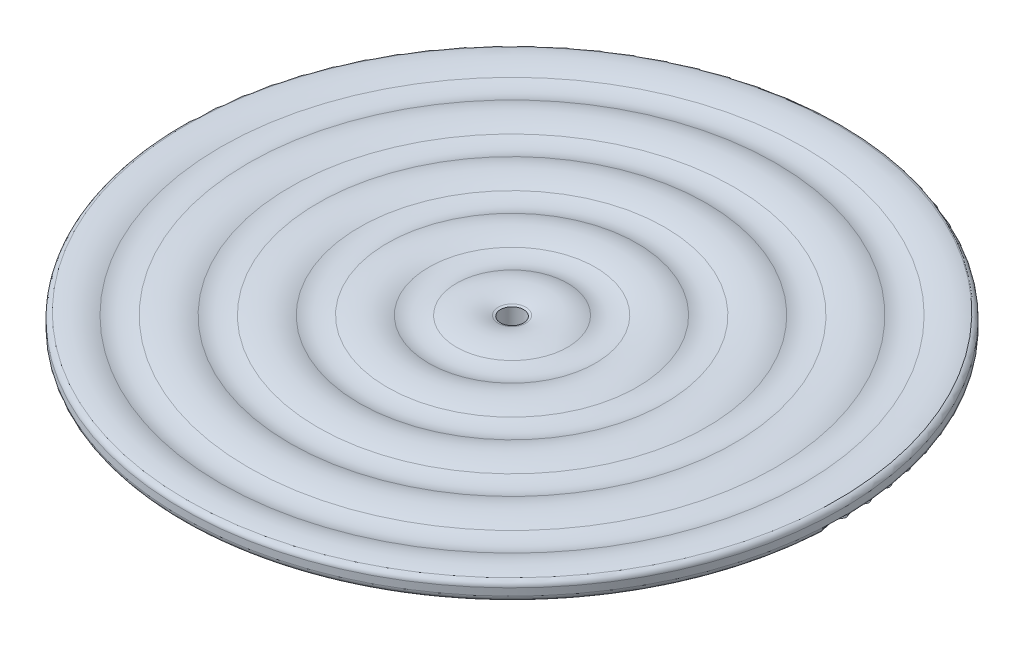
ISO-10303-21;
HEADER;
FILE_DESCRIPTION(('STEP AP214'),'2;1');
FILE_NAME('part.step','',(''),(''),'','','');
FILE_SCHEMA(('AUTOMOTIVE_DESIGN { 1 0 10303 214 1 1 1 1 }'));
ENDSEC;
DATA;
#1=APPLICATION_CONTEXT('core data for automotive mechanical design processes');
#2=APPLICATION_PROTOCOL_DEFINITION('international standard','automotive_design',2000,#1);
#3=PRODUCT_CONTEXT('',#1,'mechanical');
#4=PRODUCT('Part','Part','',(#3));
#5=PRODUCT_RELATED_PRODUCT_CATEGORY('part','',(#4));
#6=PRODUCT_DEFINITION_FORMATION('','',#4);
#7=PRODUCT_DEFINITION_CONTEXT('part definition',#1,'design');
#8=PRODUCT_DEFINITION('design','',#6,#7);
#9=PRODUCT_DEFINITION_SHAPE('','',#8);
#10=(LENGTH_UNIT() NAMED_UNIT(*) SI_UNIT(.MILLI.,.METRE.));
#11=(NAMED_UNIT(*) PLANE_ANGLE_UNIT() SI_UNIT($,.RADIAN.));
#12=(NAMED_UNIT(*) SI_UNIT($,.STERADIAN.) SOLID_ANGLE_UNIT());
#13=UNCERTAINTY_MEASURE_WITH_UNIT(LENGTH_MEASURE(1.E-05),#10,'distance_accuracy_value','');
#14=(GEOMETRIC_REPRESENTATION_CONTEXT(3) GLOBAL_UNCERTAINTY_ASSIGNED_CONTEXT((#13)) GLOBAL_UNIT_ASSIGNED_CONTEXT((#10,
#11,#12)) REPRESENTATION_CONTEXT('',''));
#15=CARTESIAN_POINT('',(0.,0.,0.));
#16=DIRECTION('',(0.,0.,1.));
#17=DIRECTION('',(1.,0.,0.));
#18=AXIS2_PLACEMENT_3D('',#15,#16,#17);
#19=CARTESIAN_POINT('',(0.,18.5404962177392,0.));
#20=DIRECTION('',(0.,1.,0.));
#21=DIRECTION('',(1.,0.,0.));
#22=AXIS2_PLACEMENT_3D('',#19,#20,#21);
#23=SPHERICAL_SURFACE('',#22,24.);
#24=CARTESIAN_POINT('',(0.,-3.70809924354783,0.));
#25=DIRECTION('',(0.,1.,0.));
#26=DIRECTION('',(0.,0.,1.));
#27=AXIS2_PLACEMENT_3D('',#24,#25,#26);
#28=CIRCLE('',#27,8.99999999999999);
#29=CARTESIAN_POINT('',(8.99999999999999,-3.70809924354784,0.));
#30=VERTEX_POINT('',#29);
#31=EDGE_CURVE('E75',#30,#30,#28,.T.);
#32=CARTESIAN_POINT('',(0.,-4.93289297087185,0.));
#33=DIRECTION('',(0.,1.,0.));
#34=DIRECTION('',(0.,0.,1.));
#35=AXIS2_PLACEMENT_3D('',#32,#33,#34);
#36=CIRCLE('',#35,5.);
#37=CARTESIAN_POINT('',(4.99999999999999,-4.93289297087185,0.));
#38=VERTEX_POINT('',#37);
#39=EDGE_CURVE('E105',#38,#38,#36,.F.);
#40=CARTESIAN_POINT('',(8.99999999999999,-3.70809924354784,0.));
#41=CARTESIAN_POINT('',(8.95955247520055,-3.7244610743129,0.));
#42=CARTESIAN_POINT('',(8.91906033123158,-3.74071260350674,0.));
#43=CARTESIAN_POINT('',(8.83798801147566,-3.7729945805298,0.));
#44=CARTESIAN_POINT('',(8.79740783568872,-3.78902502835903,0.));
#45=CARTESIAN_POINT('',(8.71616065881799,-3.82086436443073,0.));
#46=CARTESIAN_POINT('',(8.67549365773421,-3.8366732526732,0.));
#47=CARTESIAN_POINT('',(8.5940740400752,-3.86806899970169,0.));
#48=CARTESIAN_POINT('',(8.55332142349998,-3.88365585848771,0.));
#49=CARTESIAN_POINT('',(8.47173178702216,-3.91460708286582,0.));
#50=CARTESIAN_POINT('',(8.43089476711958,-3.92997144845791,0.));
#51=CARTESIAN_POINT('',(8.34913753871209,-3.96047722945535,0.));
#52=CARTESIAN_POINT('',(8.3082173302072,-3.97561864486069,0.));
#53=CARTESIAN_POINT('',(8.22629494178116,-4.00567807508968,0.));
#54=CARTESIAN_POINT('',(8.18529276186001,-4.02059608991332,0.));
#55=CARTESIAN_POINT('',(8.10320765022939,-4.05020827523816,0.));
#56=CARTESIAN_POINT('',(8.06212471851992,-4.06490244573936,0.));
#57=CARTESIAN_POINT('',(7.97987932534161,-4.09406650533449,0.));
#58=CARTESIAN_POINT('',(7.93871686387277,-4.10853639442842,0.));
#59=CARTESIAN_POINT('',(7.85631363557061,-4.13725146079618,0.));
#60=CARTESIAN_POINT('',(7.81507286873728,-4.15149663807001,0.));
#61=CARTESIAN_POINT('',(7.73251425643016,-4.17976185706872,0.));
#62=CARTESIAN_POINT('',(7.69119641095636,-4.19378189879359,0.));
#63=CARTESIAN_POINT('',(7.60848487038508,-4.22159642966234,0.));
#64=CARTESIAN_POINT('',(7.56709117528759,-4.23539091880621,0.));
#65=CARTESIAN_POINT('',(7.48422916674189,-4.26275393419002,0.));
#66=CARTESIAN_POINT('',(7.44276085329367,-4.27632246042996,0.));
#67=CARTESIAN_POINT('',(7.359750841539,-4.30323314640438,0.));
#68=CARTESIAN_POINT('',(7.31820914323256,-4.31657530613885,0.));
#69=CARTESIAN_POINT('',(7.23505359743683,-4.34303286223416,0.));
#70=CARTESIAN_POINT('',(7.19343974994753,-4.35614825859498,0.));
#71=CARTESIAN_POINT('',(7.11014114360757,-4.38215189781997,0.));
#72=CARTESIAN_POINT('',(7.0684563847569,-4.39504014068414,0.));
#73=CARTESIAN_POINT('',(6.98501719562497,-4.42058908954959,0.));
#74=CARTESIAN_POINT('',(6.94326276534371,-4.43324979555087,0.));
#75=CARTESIAN_POINT('',(6.85968547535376,-4.45834329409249,0.));
#76=CARTESIAN_POINT('',(6.81786261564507,-4.47077608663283,0.));
#77=CARTESIAN_POINT('',(6.7341497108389,-4.4954133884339,0.));
#78=CARTESIAN_POINT('',(6.69225966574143,-4.50761789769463,0.));
#79=CARTESIAN_POINT('',(6.60841363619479,-4.5317982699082,0.));
#80=CARTESIAN_POINT('',(6.56645765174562,-4.54377413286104,0.));
#81=CARTESIAN_POINT('',(6.48248099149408,-4.56749685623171,0.));
#82=CARTESIAN_POINT('',(6.44046031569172,-4.57924371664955,0.));
#83=CARTESIAN_POINT('',(6.35635552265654,-4.6025080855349,0.));
#84=CARTESIAN_POINT('',(6.31427140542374,-4.61402559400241,0.));
#85=CARTESIAN_POINT('',(6.23004098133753,-4.63683091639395,0.));
#86=CARTESIAN_POINT('',(6.18789467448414,-4.64811873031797,0.));
#87=CARTESIAN_POINT('',(6.10354112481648,-4.67046432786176,0.));
#88=CARTESIAN_POINT('',(6.06133388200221,-4.68152211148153,0.));
#89=CARTESIAN_POINT('',(5.97685971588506,-4.70340731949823,0.));
#90=CARTESIAN_POINT('',(5.93459279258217,-4.71423474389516,0.));
#91=CARTESIAN_POINT('',(5.85000052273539,-4.7356589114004,0.));
#92=CARTESIAN_POINT('',(5.80767517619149,-4.74625565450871,0.));
#93=CARTESIAN_POINT('',(5.72296731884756,-4.7672181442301,0.));
#94=CARTESIAN_POINT('',(5.68058480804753,-4.77758389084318,0.));
#95=CARTESIAN_POINT('',(5.59576388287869,-4.79808407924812,0.));
#96=CARTESIAN_POINT('',(5.55332546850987,-4.80821852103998,0.));
#97=CARTESIAN_POINT('',(5.46839399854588,-4.82825579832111,0.));
#98=CARTESIAN_POINT('',(5.4259009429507,-4.83815863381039,0.));
#99=CARTESIAN_POINT('',(5.34086145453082,-4.85773240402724,0.));
#100=CARTESIAN_POINT('',(5.29831502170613,-4.86740333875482,0.));
#101=CARTESIAN_POINT('',(5.21317004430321,-4.88651301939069,0.));
#102=CARTESIAN_POINT('',(5.17057149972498,-4.89595176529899,0.));
#103=CARTESIAN_POINT('',(5.08532356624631,-4.91459678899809,0.));
#104=CARTESIAN_POINT('',(5.04267417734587,-4.92380306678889,0.));
#105=CARTESIAN_POINT('',(4.99999999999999,-4.93289297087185,0.));
#106=B_SPLINE_CURVE_WITH_KNOTS('',3,(#40,#41,#42,#43,#44,#45,#46,#47,#48,#49,#50,#51,#52,#53,
#54,#55,#56,#57,#58,#59,#60,#61,#62,#63,#64,#65,#66,#67,#68,#69,#70,#71,#72,#73,#74,#75,#76,#77,
#78,#79,#80,#81,#82,#83,#84,#85,#86,#87,#88,#89,#90,#91,#92,#93,#94,#95,#96,#97,#98,#99,#100,
#101,#102,#103,#104,#105),.UNSPECIFIED.,.F.,.F.,(4,2,2,2,2,2,2,2,2,2,2,2,2,2,2,2,2,2,2,2,2,2,2,
2,2,2,2,2,2,2,2,2,4),(0.,0.130894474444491,0.261788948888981,0.392683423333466,
0.523577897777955,0.654472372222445,0.785366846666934,0.916261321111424,1.04715579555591,
1.1780502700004,1.30894474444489,1.43983921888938,1.57073369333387,1.70162816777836,
1.83252264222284,1.96341711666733,2.09431159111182,2.22520606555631,2.3561005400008,
2.48699501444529,2.61788948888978,2.74878396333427,2.87967843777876,3.01057291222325,
3.14146738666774,3.27236186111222,3.40325633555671,3.5341508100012,3.66504528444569,
3.79593975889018,3.92683423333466,4.05772870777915,4.18862318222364),.UNSPECIFIED.);
#107=EDGE_CURVE('BSEAM31',#30,#38,#106,.T.);
#108=ORIENTED_EDGE('',*,*,#31,.F.);
#109=ORIENTED_EDGE('',*,*,#39,.F.);
#110=ORIENTED_EDGE('',*,*,#107,.T.);
#111=ORIENTED_EDGE('',*,*,#107,.F.);
#112=EDGE_LOOP('',(#108,#110,#109,#111));
#113=FACE_BOUND('',#112,.T.);
#114=ADVANCED_FACE('F31',(#113),#23,.T.);
#115=CARTESIAN_POINT('',(0.,18.5404962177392,0.));
#116=DIRECTION('',(0.,1.,0.));
#117=DIRECTION('',(1.,0.,0.));
#118=AXIS2_PLACEMENT_3D('',#115,#116,#117);
#119=SPHERICAL_SURFACE('',#118,16.);
#120=CARTESIAN_POINT('',(0.,3.70809924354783,0.));
#121=DIRECTION('',(0.,1.,0.));
#122=DIRECTION('',(0.,0.,1.));
#123=AXIS2_PLACEMENT_3D('',#120,#121,#122);
#124=CIRCLE('',#123,6.);
#125=CARTESIAN_POINT('',(6.,3.70809924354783,0.));
#126=VERTEX_POINT('',#125);
#127=EDGE_CURVE('E78',#126,#126,#124,.T.);
#128=CARTESIAN_POINT('',(0.,3.34181206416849,0.));
#129=DIRECTION('',(0.,1.,0.));
#130=DIRECTION('',(0.,0.,1.));
#131=AXIS2_PLACEMENT_3D('',#128,#129,#130);
#132=CIRCLE('',#131,5.);
#133=CARTESIAN_POINT('',(5.,3.34181206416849,0.));
#134=VERTEX_POINT('',#133);
#135=EDGE_CURVE('E35',#134,#134,#132,.T.);
#136=CARTESIAN_POINT('',(6.,3.70809924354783,0.));
#137=CARTESIAN_POINT('',(5.98971418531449,3.7039384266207,0.));
#138=CARTESIAN_POINT('',(5.97942404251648,3.69978830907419,0.));
#139=CARTESIAN_POINT('',(5.95883514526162,3.6915094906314,0.));
#140=CARTESIAN_POINT('',(5.94853639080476,3.68738078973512,0.));
#141=CARTESIAN_POINT('',(5.92793031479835,3.67914482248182,0.));
#142=CARTESIAN_POINT('',(5.91762299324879,3.67503755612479,0.));
#143=CARTESIAN_POINT('',(5.89699982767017,3.66684447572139,0.));
#144=CARTESIAN_POINT('',(5.8866839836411,3.66275866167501,0.));
#145=CARTESIAN_POINT('',(5.86604381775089,3.65460850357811,0.));
#146=CARTESIAN_POINT('',(5.85571949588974,3.65054415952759,0.));
#147=CARTESIAN_POINT('',(5.83506241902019,3.64243695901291,0.));
#148=CARTESIAN_POINT('',(5.82472966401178,3.63839410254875,0.));
#149=CARTESIAN_POINT('',(5.80405576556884,3.63032989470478,0.));
#150=CARTESIAN_POINT('',(5.79371462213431,3.62630854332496,0.));
#151=CARTESIAN_POINT('',(5.77302399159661,3.61828736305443,0.));
#152=CARTESIAN_POINT('',(5.76267450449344,3.61428753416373,0.));
#153=CARTESIAN_POINT('',(5.74196723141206,3.60630941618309,0.));
#154=CARTESIAN_POINT('',(5.73160944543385,3.60233112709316,0.));
#155=CARTESIAN_POINT('',(5.71088561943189,3.59439610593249,0.));
#156=CARTESIAN_POINT('',(5.70051957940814,3.59043937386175,0.));
#157=CARTESIAN_POINT('',(5.67977929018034,3.58254748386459,0.));
#158=CARTESIAN_POINT('',(5.6694050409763,3.57861232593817,0.));
#159=CARTESIAN_POINT('',(5.64864837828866,3.5707636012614,0.));
#160=CARTESIAN_POINT('',(5.63826596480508,3.56685003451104,0.));
#161=CARTESIAN_POINT('',(5.61749301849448,3.5590445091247,0.));
#162=CARTESIAN_POINT('',(5.60710248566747,3.55515255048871,0.));
#163=CARTESIAN_POINT('',(5.58631334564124,3.54739025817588,0.));
#164=CARTESIAN_POINT('',(5.57591473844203,3.54351992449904,0.));
#165=CARTESIAN_POINT('',(5.55510949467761,3.53580089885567,0.));
#166=CARTESIAN_POINT('',(5.5447028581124,3.53195220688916,0.));
#167=CARTESIAN_POINT('',(5.52388160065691,3.52427648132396,0.));
#168=CARTESIAN_POINT('',(5.51346697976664,3.52044944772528,0.));
#169=CARTESIAN_POINT('',(5.49262979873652,3.51281705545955,0.));
#170=CARTESIAN_POINT('',(5.48220723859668,3.50901169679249,0.));
#171=CARTESIAN_POINT('',(5.4613542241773,3.50142267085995,0.));
#172=CARTESIAN_POINT('',(5.45092376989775,3.49763900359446,0.));
#173=CARTESIAN_POINT('',(5.43005501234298,3.49009337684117,0.));
#174=CARTESIAN_POINT('',(5.41961670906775,3.48633141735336,0.));
#175=CARTESIAN_POINT('',(5.39873229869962,3.47882922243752,0.));
#176=CARTESIAN_POINT('',(5.38828619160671,3.47508898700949,0.));
#177=CARTESIAN_POINT('',(5.36738621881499,3.46763025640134,0.));
#178=CARTESIAN_POINT('',(5.35693235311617,3.46391176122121,0.));
#179=CARTESIAN_POINT('',(5.33601690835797,3.45649652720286,0.));
#180=CARTESIAN_POINT('',(5.3255553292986,3.45279978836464,0.));
#181=CARTESIAN_POINT('',(5.30462450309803,3.44542808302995,0.));
#182=CARTESIAN_POINT('',(5.29415525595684,3.44175311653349,0.));
#183=CARTESIAN_POINT('',(5.27320913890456,3.43442497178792,0.));
#184=CARTESIAN_POINT('',(5.26273226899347,3.43077179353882,0.));
#185=CARTESIAN_POINT('',(5.24177095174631,3.42348724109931,0.));
#186=CARTESIAN_POINT('',(5.23128650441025,3.41985586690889,0.));
#187=CARTESIAN_POINT('',(5.21031007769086,3.41261493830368,0.));
#188=CARTESIAN_POINT('',(5.19981809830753,3.40900538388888,0.));
#189=CARTESIAN_POINT('',(5.17882665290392,3.40180811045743,0.));
#190=CARTESIAN_POINT('',(5.16832718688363,3.39822039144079,0.));
#191=CARTESIAN_POINT('',(5.14732081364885,3.39106680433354,0.));
#192=CARTESIAN_POINT('',(5.13681390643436,3.38750093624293,0.));
#193=CARTESIAN_POINT('',(5.11579269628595,3.38039106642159,0.));
#194=CARTESIAN_POINT('',(5.10527839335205,3.37684706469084,0.));
#195=CARTESIAN_POINT('',(5.08424243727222,3.36978094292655,0.));
#196=CARTESIAN_POINT('',(5.07372078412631,3.36625882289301,0.));
#197=CARTESIAN_POINT('',(5.05267017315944,3.35923647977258,0.));
#198=CARTESIAN_POINT('',(5.04214121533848,3.35573625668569,0.));
#199=CARTESIAN_POINT('',(5.02107604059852,3.34875772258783,0.));
#200=CARTESIAN_POINT('',(5.01053982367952,3.34527941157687,0.));
#201=CARTESIAN_POINT('',(5.,3.34181206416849,0.));
#202=B_SPLINE_CURVE_WITH_KNOTS('',3,(#136,#137,#138,#139,#140,#141,#142,#143,#144,#145,#146,
#147,#148,#149,#150,#151,#152,#153,#154,#155,#156,#157,#158,#159,#160,#161,#162,#163,#164,#165,
#166,#167,#168,#169,#170,#171,#172,#173,#174,#175,#176,#177,#178,#179,#180,#181,#182,#183,#184,
#185,#186,#187,#188,#189,#190,#191,#192,#193,#194,#195,#196,#197,#198,#199,#200,#201),
.UNSPECIFIED.,.F.,.F.,(4,2,2,2,2,2,2,2,2,2,2,2,2,2,2,2,2,2,2,2,2,2,2,2,2,2,2,2,2,2,2,2,4),(0.,
0.0332865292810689,0.0665730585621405,0.0998595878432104,0.133146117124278,0.166432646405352,
0.199719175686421,0.233005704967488,0.266292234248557,0.29957876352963,0.332865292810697,
0.366151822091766,0.39943835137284,0.432724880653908,0.466011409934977,0.499297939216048,
0.532584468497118,0.565870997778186,0.599157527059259,0.632444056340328,0.665730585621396,
0.699017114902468,0.732303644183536,0.765590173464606,0.798876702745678,0.832163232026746,
0.865449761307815,0.898736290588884,0.932022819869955,0.965309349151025,0.998595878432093,
1.03188240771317,1.06516893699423),.UNSPECIFIED.);
#203=EDGE_CURVE('BSEAM114',#126,#134,#202,.T.);
#204=ORIENTED_EDGE('',*,*,#127,.T.);
#205=ORIENTED_EDGE('',*,*,#135,.F.);
#206=ORIENTED_EDGE('',*,*,#203,.T.);
#207=ORIENTED_EDGE('',*,*,#203,.F.);
#208=EDGE_LOOP('',(#204,#206,#205,#207));
#209=FACE_BOUND('',#208,.T.);
#210=ADVANCED_FACE('F114',(#209),#119,.F.);
#211=CARTESIAN_POINT('',(0.,-18.5404962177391,0.));
#212=DIRECTION('',(0.,1.,0.));
#213=DIRECTION('',(0.,0.,1.));
#214=AXIS2_PLACEMENT_3D('',#211,#212,#213);
#215=TOROIDAL_SURFACE('',#214,135.,16.);
#216=CARTESIAN_POINT('',(0.,-3.1359443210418,0.));
#217=DIRECTION('',(0.,-1.,0.));
#218=DIRECTION('',(0.,0.,-1.));
#219=AXIS2_PLACEMENT_3D('',#216,#217,#218);
#220=CIRCLE('',#219,139.324324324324);
#221=CARTESIAN_POINT('',(0.,-3.1359443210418,-139.324324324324));
#222=VERTEX_POINT('',#221);
#223=EDGE_CURVE('E39',#222,#222,#220,.T.);
#224=ORIENTED_EDGE('',*,*,#223,.T.);
#225=EDGE_LOOP('',(#224));
#226=FACE_BOUND('',#225,.T.);
#227=CARTESIAN_POINT('',(0.,-3.70809924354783,0.));
#228=DIRECTION('',(0.,1.,0.));
#229=DIRECTION('',(0.,0.,1.));
#230=AXIS2_PLACEMENT_3D('',#227,#228,#229);
#231=CIRCLE('',#230,129.);
#232=CARTESIAN_POINT('',(0.,-3.70809924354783,129.));
#233=VERTEX_POINT('',#232);
#234=EDGE_CURVE('E51',#233,#233,#231,.T.);
#235=ORIENTED_EDGE('',*,*,#234,.T.);
#236=EDGE_LOOP('',(#235));
#237=FACE_BOUND('',#236,.T.);
#238=ADVANCED_FACE('F116',(#226,#237),#215,.F.);
#239=CARTESIAN_POINT('',(0.,18.5404962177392,0.));
#240=DIRECTION('',(0.,1.,0.));
#241=DIRECTION('',(0.,0.,1.));
#242=AXIS2_PLACEMENT_3D('',#239,#240,#241);
#243=TOROIDAL_SURFACE('',#242,120.,24.);
#244=ORIENTED_EDGE('',*,*,#234,.F.);
#245=EDGE_LOOP('',(#244));
#246=FACE_BOUND('',#245,.T.);
#247=CARTESIAN_POINT('',(0.,-3.70809924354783,0.));
#248=DIRECTION('',(0.,1.,0.));
#249=DIRECTION('',(0.,0.,1.));
#250=AXIS2_PLACEMENT_3D('',#247,#248,#249);
#251=CIRCLE('',#250,111.);
#252=CARTESIAN_POINT('',(0.,-3.70809924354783,111.));
#253=VERTEX_POINT('',#252);
#254=EDGE_CURVE('E54',#253,#253,#251,.T.);
#255=ORIENTED_EDGE('',*,*,#254,.T.);
#256=EDGE_LOOP('',(#255));
#257=FACE_BOUND('',#256,.T.);
#258=ADVANCED_FACE('F123',(#246,#257),#243,.T.);
#259=CARTESIAN_POINT('',(0.,-18.5404962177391,0.));
#260=DIRECTION('',(0.,1.,0.));
#261=DIRECTION('',(0.,0.,1.));
#262=AXIS2_PLACEMENT_3D('',#259,#260,#261);
#263=TOROIDAL_SURFACE('',#262,105.,16.);
#264=ORIENTED_EDGE('',*,*,#254,.F.);
#265=EDGE_LOOP('',(#264));
#266=FACE_BOUND('',#265,.T.);
#267=CARTESIAN_POINT('',(0.,-3.70809924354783,0.));
#268=DIRECTION('',(0.,1.,0.));
#269=DIRECTION('',(0.,0.,1.));
#270=AXIS2_PLACEMENT_3D('',#267,#268,#269);
#271=CIRCLE('',#270,99.);
#272=CARTESIAN_POINT('',(0.,-3.70809924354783,99.));
#273=VERTEX_POINT('',#272);
#274=EDGE_CURVE('E57',#273,#273,#271,.T.);
#275=ORIENTED_EDGE('',*,*,#274,.T.);
#276=EDGE_LOOP('',(#275));
#277=FACE_BOUND('',#276,.T.);
#278=ADVANCED_FACE('F155',(#266,#277),#263,.F.);
#279=CARTESIAN_POINT('',(0.,18.5404962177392,0.));
#280=DIRECTION('',(0.,1.,0.));
#281=DIRECTION('',(0.,0.,1.));
#282=AXIS2_PLACEMENT_3D('',#279,#280,#281);
#283=TOROIDAL_SURFACE('',#282,90.,24.);
#284=ORIENTED_EDGE('',*,*,#274,.F.);
#285=EDGE_LOOP('',(#284));
#286=FACE_BOUND('',#285,.T.);
#287=CARTESIAN_POINT('',(0.,-3.70809924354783,0.));
#288=DIRECTION('',(0.,1.,0.));
#289=DIRECTION('',(0.,0.,1.));
#290=AXIS2_PLACEMENT_3D('',#287,#288,#289);
#291=CIRCLE('',#290,81.);
#292=CARTESIAN_POINT('',(0.,-3.70809924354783,81.));
#293=VERTEX_POINT('',#292);
#294=EDGE_CURVE('E60',#293,#293,#291,.T.);
#295=ORIENTED_EDGE('',*,*,#294,.T.);
#296=EDGE_LOOP('',(#295));
#297=FACE_BOUND('',#296,.T.);
#298=ADVANCED_FACE('F151',(#286,#297),#283,.T.);
#299=CARTESIAN_POINT('',(0.,-18.5404962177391,0.));
#300=DIRECTION('',(0.,1.,0.));
#301=DIRECTION('',(0.,0.,1.));
#302=AXIS2_PLACEMENT_3D('',#299,#300,#301);
#303=TOROIDAL_SURFACE('',#302,75.,16.);
#304=ORIENTED_EDGE('',*,*,#294,.F.);
#305=EDGE_LOOP('',(#304));
#306=FACE_BOUND('',#305,.T.);
#307=CARTESIAN_POINT('',(0.,-3.70809924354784,0.));
#308=DIRECTION('',(0.,1.,0.));
#309=DIRECTION('',(0.,0.,1.));
#310=AXIS2_PLACEMENT_3D('',#307,#308,#309);
#311=CIRCLE('',#310,69.);
#312=CARTESIAN_POINT('',(0.,-3.70809924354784,69.));
#313=VERTEX_POINT('',#312);
#314=EDGE_CURVE('E63',#313,#313,#311,.T.);
#315=ORIENTED_EDGE('',*,*,#314,.T.);
#316=EDGE_LOOP('',(#315));
#317=FACE_BOUND('',#316,.T.);
#318=ADVANCED_FACE('F147',(#306,#317),#303,.F.);
#319=CARTESIAN_POINT('',(0.,18.5404962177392,0.));
#320=DIRECTION('',(0.,1.,0.));
#321=DIRECTION('',(0.,0.,1.));
#322=AXIS2_PLACEMENT_3D('',#319,#320,#321);
#323=TOROIDAL_SURFACE('',#322,60.,24.);
#324=ORIENTED_EDGE('',*,*,#314,.F.);
#325=EDGE_LOOP('',(#324));
#326=FACE_BOUND('',#325,.T.);
#327=CARTESIAN_POINT('',(0.,-3.70809924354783,0.));
#328=DIRECTION('',(0.,1.,0.));
#329=DIRECTION('',(0.,0.,1.));
#330=AXIS2_PLACEMENT_3D('',#327,#328,#329);
#331=CIRCLE('',#330,51.);
#332=CARTESIAN_POINT('',(0.,-3.70809924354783,51.));
#333=VERTEX_POINT('',#332);
#334=EDGE_CURVE('E66',#333,#333,#331,.T.);
#335=ORIENTED_EDGE('',*,*,#334,.T.);
#336=EDGE_LOOP('',(#335));
#337=FACE_BOUND('',#336,.T.);
#338=ADVANCED_FACE('F143',(#326,#337),#323,.T.);
#339=CARTESIAN_POINT('',(0.,-18.5404962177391,0.));
#340=DIRECTION('',(0.,1.,0.));
#341=DIRECTION('',(0.,0.,1.));
#342=AXIS2_PLACEMENT_3D('',#339,#340,#341);
#343=TOROIDAL_SURFACE('',#342,45.,16.);
#344=ORIENTED_EDGE('',*,*,#334,.F.);
#345=EDGE_LOOP('',(#344));
#346=FACE_BOUND('',#345,.T.);
#347=CARTESIAN_POINT('',(0.,-3.70809924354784,0.));
#348=DIRECTION('',(0.,1.,0.));
#349=DIRECTION('',(0.,0.,1.));
#350=AXIS2_PLACEMENT_3D('',#347,#348,#349);
#351=CIRCLE('',#350,39.);
#352=CARTESIAN_POINT('',(0.,-3.70809924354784,39.));
#353=VERTEX_POINT('',#352);
#354=EDGE_CURVE('E69',#353,#353,#351,.T.);
#355=ORIENTED_EDGE('',*,*,#354,.T.);
#356=EDGE_LOOP('',(#355));
#357=FACE_BOUND('',#356,.T.);
#358=ADVANCED_FACE('F139',(#346,#357),#343,.F.);
#359=CARTESIAN_POINT('',(0.,18.5404962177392,0.));
#360=DIRECTION('',(0.,1.,0.));
#361=DIRECTION('',(0.,0.,1.));
#362=AXIS2_PLACEMENT_3D('',#359,#360,#361);
#363=TOROIDAL_SURFACE('',#362,30.,24.);
#364=ORIENTED_EDGE('',*,*,#354,.F.);
#365=EDGE_LOOP('',(#364));
#366=FACE_BOUND('',#365,.T.);
#367=CARTESIAN_POINT('',(0.,-3.70809924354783,0.));
#368=DIRECTION('',(0.,1.,0.));
#369=DIRECTION('',(0.,0.,1.));
#370=AXIS2_PLACEMENT_3D('',#367,#368,#369);
#371=CIRCLE('',#370,21.);
#372=CARTESIAN_POINT('',(0.,-3.70809924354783,21.));
#373=VERTEX_POINT('',#372);
#374=EDGE_CURVE('E72',#373,#373,#371,.T.);
#375=ORIENTED_EDGE('',*,*,#374,.T.);
#376=EDGE_LOOP('',(#375));
#377=FACE_BOUND('',#376,.T.);
#378=ADVANCED_FACE('F135',(#366,#377),#363,.T.);
#379=CARTESIAN_POINT('',(0.,-18.5404962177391,0.));
#380=DIRECTION('',(0.,1.,0.));
#381=DIRECTION('',(0.,0.,1.));
#382=AXIS2_PLACEMENT_3D('',#379,#380,#381);
#383=DEGENERATE_TOROIDAL_SURFACE('',#382,15.,16.,.T.);
#384=ORIENTED_EDGE('',*,*,#374,.F.);
#385=EDGE_LOOP('',(#384));
#386=FACE_BOUND('',#385,.T.);
#387=ORIENTED_EDGE('',*,*,#31,.T.);
#388=EDGE_LOOP('',(#387));
#389=FACE_BOUND('',#388,.T.);
#390=ADVANCED_FACE('F132',(#386,#389),#383,.F.);
#391=CARTESIAN_POINT('',(0.,-18.5404962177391,0.));
#392=DIRECTION('',(0.,1.,0.));
#393=DIRECTION('',(0.,0.,1.));
#394=AXIS2_PLACEMENT_3D('',#391,#392,#393);
#395=DEGENERATE_TOROIDAL_SURFACE('',#394,15.,24.,.T.);
#396=ORIENTED_EDGE('',*,*,#127,.F.);
#397=EDGE_LOOP('',(#396));
#398=FACE_BOUND('',#397,.T.);
#399=CARTESIAN_POINT('',(0.,3.70809924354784,0.));
#400=DIRECTION('',(0.,1.,0.));
#401=DIRECTION('',(0.,0.,1.));
#402=AXIS2_PLACEMENT_3D('',#399,#400,#401);
#403=CIRCLE('',#402,24.);
#404=CARTESIAN_POINT('',(0.,3.70809924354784,24.));
#405=VERTEX_POINT('',#404);
#406=EDGE_CURVE('E81',#405,#405,#403,.T.);
#407=ORIENTED_EDGE('',*,*,#406,.T.);
#408=EDGE_LOOP('',(#407));
#409=FACE_BOUND('',#408,.T.);
#410=ADVANCED_FACE('F129',(#398,#409),#395,.T.);
#411=CARTESIAN_POINT('',(0.,18.5404962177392,0.));
#412=DIRECTION('',(0.,1.,0.));
#413=DIRECTION('',(0.,0.,1.));
#414=AXIS2_PLACEMENT_3D('',#411,#412,#413);
#415=TOROIDAL_SURFACE('',#414,30.,16.);
#416=ORIENTED_EDGE('',*,*,#406,.F.);
#417=EDGE_LOOP('',(#416));
#418=FACE_BOUND('',#417,.T.);
#419=CARTESIAN_POINT('',(0.,3.70809924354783,0.));
#420=DIRECTION('',(0.,1.,0.));
#421=DIRECTION('',(0.,0.,1.));
#422=AXIS2_PLACEMENT_3D('',#419,#420,#421);
#423=CIRCLE('',#422,36.);
#424=CARTESIAN_POINT('',(0.,3.70809924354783,36.));
#425=VERTEX_POINT('',#424);
#426=EDGE_CURVE('E84',#425,#425,#423,.T.);
#427=ORIENTED_EDGE('',*,*,#426,.T.);
#428=EDGE_LOOP('',(#427));
#429=FACE_BOUND('',#428,.T.);
#430=ADVANCED_FACE('F227',(#418,#429),#415,.F.);
#431=CARTESIAN_POINT('',(0.,-18.5404962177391,0.));
#432=DIRECTION('',(0.,1.,0.));
#433=DIRECTION('',(0.,0.,1.));
#434=AXIS2_PLACEMENT_3D('',#431,#432,#433);
#435=TOROIDAL_SURFACE('',#434,45.,24.);
#436=ORIENTED_EDGE('',*,*,#426,.F.);
#437=EDGE_LOOP('',(#436));
#438=FACE_BOUND('',#437,.T.);
#439=CARTESIAN_POINT('',(0.,3.70809924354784,0.));
#440=DIRECTION('',(0.,1.,0.));
#441=DIRECTION('',(0.,0.,1.));
#442=AXIS2_PLACEMENT_3D('',#439,#440,#441);
#443=CIRCLE('',#442,54.);
#444=CARTESIAN_POINT('',(0.,3.70809924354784,54.));
#445=VERTEX_POINT('',#444);
#446=EDGE_CURVE('E87',#445,#445,#443,.T.);
#447=ORIENTED_EDGE('',*,*,#446,.T.);
#448=EDGE_LOOP('',(#447));
#449=FACE_BOUND('',#448,.T.);
#450=ADVANCED_FACE('F224',(#438,#449),#435,.T.);
#451=CARTESIAN_POINT('',(0.,18.5404962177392,0.));
#452=DIRECTION('',(0.,1.,0.));
#453=DIRECTION('',(0.,0.,1.));
#454=AXIS2_PLACEMENT_3D('',#451,#452,#453);
#455=TOROIDAL_SURFACE('',#454,60.,16.);
#456=ORIENTED_EDGE('',*,*,#446,.F.);
#457=EDGE_LOOP('',(#456));
#458=FACE_BOUND('',#457,.T.);
#459=CARTESIAN_POINT('',(0.,3.70809924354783,0.));
#460=DIRECTION('',(0.,1.,0.));
#461=DIRECTION('',(0.,0.,1.));
#462=AXIS2_PLACEMENT_3D('',#459,#460,#461);
#463=CIRCLE('',#462,66.);
#464=CARTESIAN_POINT('',(0.,3.70809924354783,66.));
#465=VERTEX_POINT('',#464);
#466=EDGE_CURVE('E90',#465,#465,#463,.T.);
#467=ORIENTED_EDGE('',*,*,#466,.T.);
#468=EDGE_LOOP('',(#467));
#469=FACE_BOUND('',#468,.T.);
#470=ADVANCED_FACE('F220',(#458,#469),#455,.F.);
#471=CARTESIAN_POINT('',(0.,-18.5404962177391,0.));
#472=DIRECTION('',(0.,1.,0.));
#473=DIRECTION('',(0.,0.,1.));
#474=AXIS2_PLACEMENT_3D('',#471,#472,#473);
#475=TOROIDAL_SURFACE('',#474,75.,24.);
#476=ORIENTED_EDGE('',*,*,#466,.F.);
#477=EDGE_LOOP('',(#476));
#478=FACE_BOUND('',#477,.T.);
#479=CARTESIAN_POINT('',(0.,3.70809924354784,0.));
#480=DIRECTION('',(0.,1.,0.));
#481=DIRECTION('',(0.,0.,1.));
#482=AXIS2_PLACEMENT_3D('',#479,#480,#481);
#483=CIRCLE('',#482,84.);
#484=CARTESIAN_POINT('',(0.,3.70809924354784,84.));
#485=VERTEX_POINT('',#484);
#486=EDGE_CURVE('E93',#485,#485,#483,.T.);
#487=ORIENTED_EDGE('',*,*,#486,.T.);
#488=EDGE_LOOP('',(#487));
#489=FACE_BOUND('',#488,.T.);
#490=ADVANCED_FACE('F216',(#478,#489),#475,.T.);
#491=CARTESIAN_POINT('',(0.,18.5404962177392,0.));
#492=DIRECTION('',(0.,1.,0.));
#493=DIRECTION('',(0.,0.,1.));
#494=AXIS2_PLACEMENT_3D('',#491,#492,#493);
#495=TOROIDAL_SURFACE('',#494,90.,16.);
#496=ORIENTED_EDGE('',*,*,#486,.F.);
#497=EDGE_LOOP('',(#496));
#498=FACE_BOUND('',#497,.T.);
#499=CARTESIAN_POINT('',(0.,3.70809924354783,0.));
#500=DIRECTION('',(0.,1.,0.));
#501=DIRECTION('',(0.,0.,1.));
#502=AXIS2_PLACEMENT_3D('',#499,#500,#501);
#503=CIRCLE('',#502,96.);
#504=CARTESIAN_POINT('',(0.,3.70809924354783,96.));
#505=VERTEX_POINT('',#504);
#506=EDGE_CURVE('E96',#505,#505,#503,.T.);
#507=ORIENTED_EDGE('',*,*,#506,.T.);
#508=EDGE_LOOP('',(#507));
#509=FACE_BOUND('',#508,.T.);
#510=ADVANCED_FACE('F212',(#498,#509),#495,.F.);
#511=CARTESIAN_POINT('',(0.,-18.5404962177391,0.));
#512=DIRECTION('',(0.,1.,0.));
#513=DIRECTION('',(0.,0.,1.));
#514=AXIS2_PLACEMENT_3D('',#511,#512,#513);
#515=TOROIDAL_SURFACE('',#514,105.,24.);
#516=ORIENTED_EDGE('',*,*,#506,.F.);
#517=EDGE_LOOP('',(#516));
#518=FACE_BOUND('',#517,.T.);
#519=CARTESIAN_POINT('',(0.,3.70809924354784,0.));
#520=DIRECTION('',(0.,1.,0.));
#521=DIRECTION('',(0.,0.,1.));
#522=AXIS2_PLACEMENT_3D('',#519,#520,#521);
#523=CIRCLE('',#522,114.);
#524=CARTESIAN_POINT('',(0.,3.70809924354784,114.));
#525=VERTEX_POINT('',#524);
#526=EDGE_CURVE('E99',#525,#525,#523,.T.);
#527=ORIENTED_EDGE('',*,*,#526,.T.);
#528=EDGE_LOOP('',(#527));
#529=FACE_BOUND('',#528,.T.);
#530=ADVANCED_FACE('F208',(#518,#529),#515,.T.);
#531=CARTESIAN_POINT('',(0.,18.5404962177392,0.));
#532=DIRECTION('',(0.,1.,0.));
#533=DIRECTION('',(0.,0.,1.));
#534=AXIS2_PLACEMENT_3D('',#531,#532,#533);
#535=TOROIDAL_SURFACE('',#534,120.,16.);
#536=ORIENTED_EDGE('',*,*,#526,.F.);
#537=EDGE_LOOP('',(#536));
#538=FACE_BOUND('',#537,.T.);
#539=CARTESIAN_POINT('',(0.,3.70809924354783,0.));
#540=DIRECTION('',(0.,1.,0.));
#541=DIRECTION('',(0.,0.,1.));
#542=AXIS2_PLACEMENT_3D('',#539,#540,#541);
#543=CIRCLE('',#542,126.);
#544=CARTESIAN_POINT('',(0.,3.70809924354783,126.));
#545=VERTEX_POINT('',#544);
#546=EDGE_CURVE('E102',#545,#545,#543,.T.);
#547=ORIENTED_EDGE('',*,*,#546,.T.);
#548=EDGE_LOOP('',(#547));
#549=FACE_BOUND('',#548,.T.);
#550=ADVANCED_FACE('F202',(#538,#549),#535,.F.);
#551=CARTESIAN_POINT('',(0.,-18.5404962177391,0.));
#552=DIRECTION('',(0.,1.,0.));
#553=DIRECTION('',(0.,0.,1.));
#554=AXIS2_PLACEMENT_3D('',#551,#552,#553);
#555=TOROIDAL_SURFACE('',#554,135.,24.);
#556=CARTESIAN_POINT('',(0.,4.80148368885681,0.));
#557=DIRECTION('',(0.,-1.,0.));
#558=DIRECTION('',(0.,0.,-1.));
#559=AXIS2_PLACEMENT_3D('',#556,#557,#558);
#560=CIRCLE('',#559,140.581395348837);
#561=CARTESIAN_POINT('',(0.,4.80148368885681,-140.581395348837));
#562=VERTEX_POINT('',#561);
#563=EDGE_CURVE('E10',#562,#562,#560,.F.);
#564=ORIENTED_EDGE('',*,*,#563,.T.);
#565=EDGE_LOOP('',(#564));
#566=FACE_BOUND('',#565,.T.);
#567=ORIENTED_EDGE('',*,*,#546,.F.);
#568=EDGE_LOOP('',(#567));
#569=FACE_BOUND('',#568,.T.);
#570=ADVANCED_FACE('F171',(#566,#569),#555,.T.);
#571=CARTESIAN_POINT('',(0.,13.2786969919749,0.));
#572=DIRECTION('',(0.,1.,0.));
#573=DIRECTION('',(0.,0.,1.));
#574=AXIS2_PLACEMENT_3D('',#571,#572,#573);
#575=CYLINDRICAL_SURFACE('',#574,142.5);
#576=CARTESIAN_POINT('',(0.,-0.728983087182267,0.));
#577=DIRECTION('',(0.,-1.,0.));
#578=DIRECTION('',(0.,0.,-1.));
#579=AXIS2_PLACEMENT_3D('',#576,#577,#578);
#580=CIRCLE('',#579,142.5);
#581=CARTESIAN_POINT('',(0.,-0.728983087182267,-142.5));
#582=VERTEX_POINT('',#581);
#583=EDGE_CURVE('E43',#582,#582,#580,.F.);
#584=ORIENTED_EDGE('',*,*,#583,.T.);
#585=EDGE_LOOP('',(#584));
#586=FACE_BOUND('',#585,.T.);
#587=CARTESIAN_POINT('',(0.,2.37002744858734,0.));
#588=DIRECTION('',(0.,-1.,0.));
#589=DIRECTION('',(0.,0.,-1.));
#590=AXIS2_PLACEMENT_3D('',#587,#588,#589);
#591=CIRCLE('',#590,142.5);
#592=CARTESIAN_POINT('',(0.,2.37002744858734,-142.5));
#593=VERTEX_POINT('',#592);
#594=EDGE_CURVE('E48',#593,#593,#591,.T.);
#595=ORIENTED_EDGE('',*,*,#594,.T.);
#596=EDGE_LOOP('',(#595));
#597=FACE_BOUND('',#596,.T.);
#598=ADVANCED_FACE('F164',(#586,#597),#575,.T.);
#599=CARTESIAN_POINT('',(0.,-0.728983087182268,0.));
#600=DIRECTION('',(0.,-1.,0.));
#601=DIRECTION('',(0.,0.,-1.));
#602=AXIS2_PLACEMENT_3D('',#599,#600,#601);
#603=TOROIDAL_SURFACE('',#602,140.,2.5);
#604=ORIENTED_EDGE('',*,*,#223,.F.);
#605=EDGE_LOOP('',(#604));
#606=FACE_BOUND('',#605,.T.);
#607=ORIENTED_EDGE('',*,*,#583,.F.);
#608=EDGE_LOOP('',(#607));
#609=FACE_BOUND('',#608,.T.);
#610=ADVANCED_FACE('F162',(#606,#609),#603,.T.);
#611=CARTESIAN_POINT('',(0.,2.37002744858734,0.));
#612=DIRECTION('',(0.,-1.,0.));
#613=DIRECTION('',(0.,0.,-1.));
#614=AXIS2_PLACEMENT_3D('',#611,#612,#613);
#615=TOROIDAL_SURFACE('',#614,140.,2.5);
#616=ORIENTED_EDGE('',*,*,#594,.F.);
#617=EDGE_LOOP('',(#616));
#618=FACE_BOUND('',#617,.T.);
#619=ORIENTED_EDGE('',*,*,#563,.F.);
#620=EDGE_LOOP('',(#619));
#621=FACE_BOUND('',#620,.T.);
#622=ADVANCED_FACE('F33',(#618,#621),#615,.T.);
#623=CARTESIAN_POINT('',(0.,10.,0.));
#624=DIRECTION('',(0.,-1.,0.));
#625=DIRECTION('',(0.,0.,-1.));
#626=AXIS2_PLACEMENT_3D('',#623,#624,#625);
#627=CYLINDRICAL_SURFACE('',#626,5.);
#628=ORIENTED_EDGE('',*,*,#135,.T.);
#629=EDGE_LOOP('',(#628));
#630=FACE_BOUND('',#629,.T.);
#631=ORIENTED_EDGE('',*,*,#39,.T.);
#632=EDGE_LOOP('',(#631));
#633=FACE_BOUND('',#632,.T.);
#634=ADVANCED_FACE('F112',(#630,#633),#627,.F.);
#635=CLOSED_SHELL('',(#114,#210,#238,#258,#278,#298,#318,#338,#358,#378,#390,#410,#430,#450,
#470,#490,#510,#530,#550,#570,#598,#610,#622,#634));
#636=MANIFOLD_SOLID_BREP('B2',#635);
#637=ADVANCED_BREP_SHAPE_REPRESENTATION('',(#18,#636),#14);
#638=SHAPE_DEFINITION_REPRESENTATION(#9,#637);
ENDSEC;
END-ISO-10303-21;
